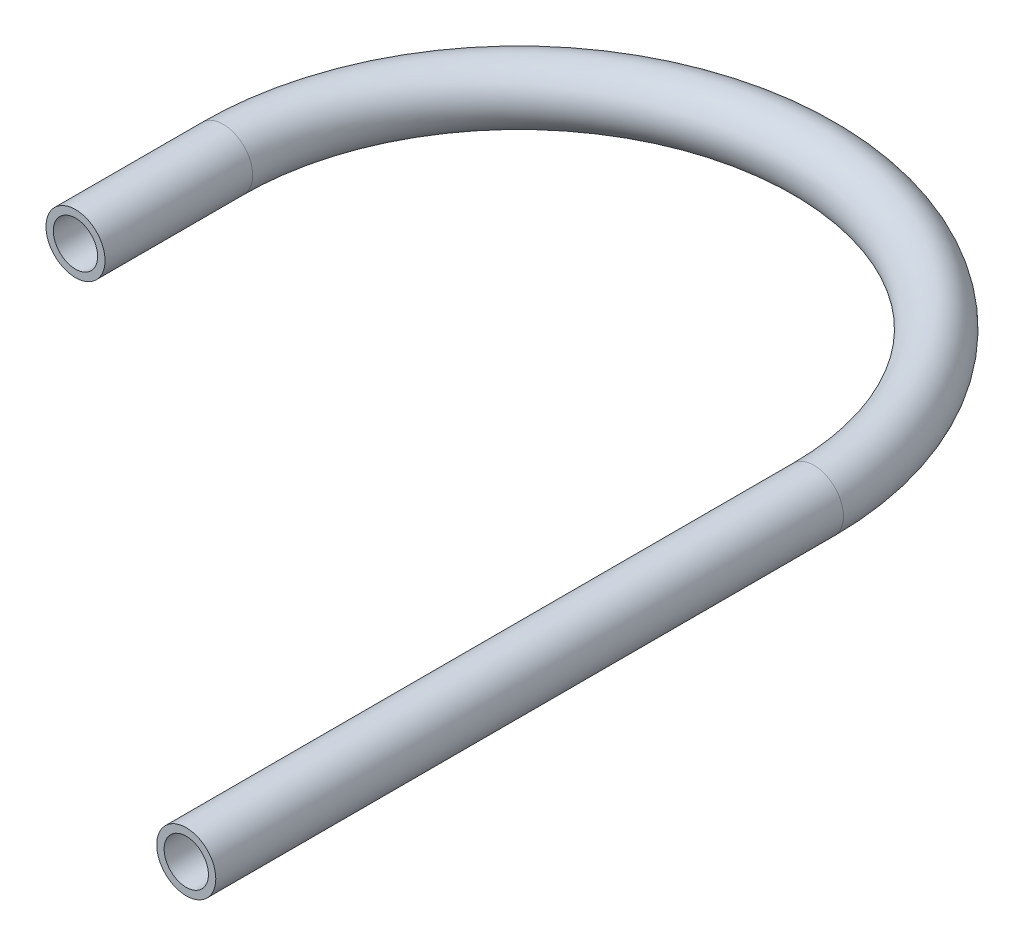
ISO-10303-21;
HEADER;
FILE_DESCRIPTION(('STEP AP214'),'2;1');
FILE_NAME('part.step','',(''),(''),'','','');
FILE_SCHEMA(('AUTOMOTIVE_DESIGN { 1 0 10303 214 1 1 1 1 }'));
ENDSEC;
DATA;
#1=APPLICATION_CONTEXT('core data for automotive mechanical design processes');
#2=APPLICATION_PROTOCOL_DEFINITION('international standard','automotive_design',2000,#1);
#3=PRODUCT_CONTEXT('',#1,'mechanical');
#4=PRODUCT('Part','Part','',(#3));
#5=PRODUCT_RELATED_PRODUCT_CATEGORY('part','',(#4));
#6=PRODUCT_DEFINITION_FORMATION('','',#4);
#7=PRODUCT_DEFINITION_CONTEXT('part definition',#1,'design');
#8=PRODUCT_DEFINITION('design','',#6,#7);
#9=PRODUCT_DEFINITION_SHAPE('','',#8);
#10=(LENGTH_UNIT() NAMED_UNIT(*) SI_UNIT(.MILLI.,.METRE.));
#11=(NAMED_UNIT(*) PLANE_ANGLE_UNIT() SI_UNIT($,.RADIAN.));
#12=(NAMED_UNIT(*) SI_UNIT($,.STERADIAN.) SOLID_ANGLE_UNIT());
#13=UNCERTAINTY_MEASURE_WITH_UNIT(LENGTH_MEASURE(1.E-05),#10,'distance_accuracy_value','');
#14=(GEOMETRIC_REPRESENTATION_CONTEXT(3) GLOBAL_UNCERTAINTY_ASSIGNED_CONTEXT((#13)) GLOBAL_UNIT_ASSIGNED_CONTEXT((#10,
#11,#12)) REPRESENTATION_CONTEXT('',''));
#15=CARTESIAN_POINT('',(0.,0.,0.));
#16=DIRECTION('',(0.,0.,1.));
#17=DIRECTION('',(1.,0.,0.));
#18=AXIS2_PLACEMENT_3D('',#15,#16,#17);
#19=CARTESIAN_POINT('',(0.,0.,0.));
#20=DIRECTION('',(0.,1.,0.));
#21=DIRECTION('',(-1.,0.,0.));
#22=AXIS2_PLACEMENT_3D('',#19,#20,#21);
#23=TOROIDAL_SURFACE('',#22,80.,6.);
#24=CARTESIAN_POINT('',(80.,0.,0.));
#25=DIRECTION('',(0.,0.,1.));
#26=DIRECTION('',(1.,0.,0.));
#27=AXIS2_PLACEMENT_3D('',#24,#25,#26);
#28=CIRCLE('',#27,6.);
#29=CARTESIAN_POINT('',(86.,0.,0.));
#30=VERTEX_POINT('',#29);
#31=EDGE_CURVE('E36',#30,#30,#28,.T.);
#32=ORIENTED_EDGE('',*,*,#31,.T.);
#33=EDGE_LOOP('',(#32));
#34=FACE_BOUND('',#33,.T.);
#35=CARTESIAN_POINT('',(-80.,0.,0.));
#36=DIRECTION('',(0.,0.,1.));
#37=DIRECTION('',(1.,0.,0.));
#38=AXIS2_PLACEMENT_3D('',#35,#36,#37);
#39=CIRCLE('',#38,6.);
#40=CARTESIAN_POINT('',(-74.,0.,0.));
#41=VERTEX_POINT('',#40);
#42=EDGE_CURVE('E34',#41,#41,#39,.T.);
#43=ORIENTED_EDGE('',*,*,#42,.T.);
#44=EDGE_LOOP('',(#43));
#45=FACE_BOUND('',#44,.T.);
#46=ADVANCED_FACE('F14',(#34,#45),#23,.F.);
#47=CARTESIAN_POINT('',(80.,0.,0.));
#48=DIRECTION('',(0.,0.,1.));
#49=DIRECTION('',(1.,0.,0.));
#50=AXIS2_PLACEMENT_3D('',#47,#48,#49);
#51=CYLINDRICAL_SURFACE('',#50,6.);
#52=CARTESIAN_POINT('',(80.,0.,170.));
#53=DIRECTION('',(0.,0.,1.));
#54=DIRECTION('',(1.,0.,0.));
#55=AXIS2_PLACEMENT_3D('',#52,#53,#54);
#56=CIRCLE('',#55,6.);
#57=CARTESIAN_POINT('',(86.,0.,170.));
#58=VERTEX_POINT('',#57);
#59=EDGE_CURVE('E18',#58,#58,#56,.F.);
#60=ORIENTED_EDGE('',*,*,#59,.F.);
#61=EDGE_LOOP('',(#60));
#62=FACE_BOUND('',#61,.T.);
#63=ORIENTED_EDGE('',*,*,#31,.F.);
#64=EDGE_LOOP('',(#63));
#65=FACE_BOUND('',#64,.T.);
#66=ADVANCED_FACE('F55',(#62,#65),#51,.F.);
#67=CARTESIAN_POINT('',(-80.,0.,0.));
#68=DIRECTION('',(0.,0.,1.));
#69=DIRECTION('',(1.,0.,0.));
#70=AXIS2_PLACEMENT_3D('',#67,#68,#69);
#71=CYLINDRICAL_SURFACE('',#70,6.);
#72=CARTESIAN_POINT('',(-80.,0.,40.));
#73=DIRECTION('',(0.,0.,1.));
#74=DIRECTION('',(1.,0.,0.));
#75=AXIS2_PLACEMENT_3D('',#72,#73,#74);
#76=CIRCLE('',#75,6.);
#77=CARTESIAN_POINT('',(-74.,0.,40.));
#78=VERTEX_POINT('',#77);
#79=EDGE_CURVE('E45',#78,#78,#76,.F.);
#80=ORIENTED_EDGE('',*,*,#79,.F.);
#81=EDGE_LOOP('',(#80));
#82=FACE_BOUND('',#81,.T.);
#83=ORIENTED_EDGE('',*,*,#42,.F.);
#84=EDGE_LOOP('',(#83));
#85=FACE_BOUND('',#84,.T.);
#86=ADVANCED_FACE('F58',(#82,#85),#71,.F.);
#87=CARTESIAN_POINT('',(0.,0.,170.));
#88=DIRECTION('',(0.,0.,1.));
#89=DIRECTION('',(1.,0.,0.));
#90=AXIS2_PLACEMENT_3D('',#87,#88,#89);
#91=PLANE('',#90);
#92=ORIENTED_EDGE('',*,*,#59,.T.);
#93=EDGE_LOOP('',(#92));
#94=FACE_BOUND('',#93,.T.);
#95=CARTESIAN_POINT('',(80.,0.,170.));
#96=DIRECTION('',(0.,0.,1.));
#97=DIRECTION('',(1.,0.,0.));
#98=AXIS2_PLACEMENT_3D('',#95,#96,#97);
#99=CIRCLE('',#98,8.);
#100=CARTESIAN_POINT('',(88.,0.,170.));
#101=VERTEX_POINT('',#100);
#102=EDGE_CURVE('E43',#101,#101,#99,.F.);
#103=ORIENTED_EDGE('',*,*,#102,.F.);
#104=EDGE_LOOP('',(#103));
#105=FACE_BOUND('',#104,.T.);
#106=ADVANCED_FACE('F52',(#94,#105),#91,.T.);
#107=CARTESIAN_POINT('',(0.,0.,40.));
#108=DIRECTION('',(0.,0.,1.));
#109=DIRECTION('',(1.,0.,0.));
#110=AXIS2_PLACEMENT_3D('',#107,#108,#109);
#111=PLANE('',#110);
#112=ORIENTED_EDGE('',*,*,#79,.T.);
#113=EDGE_LOOP('',(#112));
#114=FACE_BOUND('',#113,.T.);
#115=CARTESIAN_POINT('',(-80.,0.,40.));
#116=DIRECTION('',(0.,0.,1.));
#117=DIRECTION('',(1.,0.,0.));
#118=AXIS2_PLACEMENT_3D('',#115,#116,#117);
#119=CIRCLE('',#118,8.);
#120=CARTESIAN_POINT('',(-72.,0.,40.));
#121=VERTEX_POINT('',#120);
#122=EDGE_CURVE('E27',#121,#121,#119,.F.);
#123=ORIENTED_EDGE('',*,*,#122,.F.);
#124=EDGE_LOOP('',(#123));
#125=FACE_BOUND('',#124,.T.);
#126=ADVANCED_FACE('F73',(#114,#125),#111,.T.);
#127=CARTESIAN_POINT('',(80.,0.,0.));
#128=DIRECTION('',(0.,0.,1.));
#129=DIRECTION('',(1.,0.,0.));
#130=AXIS2_PLACEMENT_3D('',#127,#128,#129);
#131=CYLINDRICAL_SURFACE('',#130,8.);
#132=ORIENTED_EDGE('',*,*,#102,.T.);
#133=EDGE_LOOP('',(#132));
#134=FACE_BOUND('',#133,.T.);
#135=CARTESIAN_POINT('',(80.,0.,0.));
#136=DIRECTION('',(0.,0.,-1.));
#137=DIRECTION('',(1.,0.,0.));
#138=AXIS2_PLACEMENT_3D('',#135,#136,#137);
#139=CIRCLE('',#138,8.);
#140=CARTESIAN_POINT('',(88.,0.,0.));
#141=VERTEX_POINT('',#140);
#142=EDGE_CURVE('E22',#141,#141,#139,.T.);
#143=ORIENTED_EDGE('',*,*,#142,.F.);
#144=EDGE_LOOP('',(#143));
#145=FACE_BOUND('',#144,.T.);
#146=ADVANCED_FACE('F84',(#134,#145),#131,.T.);
#147=CARTESIAN_POINT('',(-80.,0.,0.));
#148=DIRECTION('',(0.,0.,1.));
#149=DIRECTION('',(1.,0.,0.));
#150=AXIS2_PLACEMENT_3D('',#147,#148,#149);
#151=CYLINDRICAL_SURFACE('',#150,8.);
#152=ORIENTED_EDGE('',*,*,#122,.T.);
#153=EDGE_LOOP('',(#152));
#154=FACE_BOUND('',#153,.T.);
#155=CARTESIAN_POINT('',(-80.,0.,0.));
#156=DIRECTION('',(0.,0.,1.));
#157=DIRECTION('',(-1.,0.,0.));
#158=AXIS2_PLACEMENT_3D('',#155,#156,#157);
#159=CIRCLE('',#158,8.);
#160=CARTESIAN_POINT('',(-88.,0.,0.));
#161=VERTEX_POINT('',#160);
#162=EDGE_CURVE('E10',#161,#161,#159,.F.);
#163=ORIENTED_EDGE('',*,*,#162,.F.);
#164=EDGE_LOOP('',(#163));
#165=FACE_BOUND('',#164,.T.);
#166=ADVANCED_FACE('F77',(#154,#165),#151,.T.);
#167=CARTESIAN_POINT('',(0.,0.,0.));
#168=DIRECTION('',(0.,1.,0.));
#169=DIRECTION('',(-1.,0.,0.));
#170=AXIS2_PLACEMENT_3D('',#167,#168,#169);
#171=TOROIDAL_SURFACE('',#170,80.,8.);
#172=ORIENTED_EDGE('',*,*,#142,.T.);
#173=EDGE_LOOP('',(#172));
#174=FACE_BOUND('',#173,.T.);
#175=ORIENTED_EDGE('',*,*,#162,.T.);
#176=EDGE_LOOP('',(#175));
#177=FACE_BOUND('',#176,.T.);
#178=ADVANCED_FACE('F75',(#174,#177),#171,.T.);
#179=CLOSED_SHELL('',(#46,#66,#86,#106,#126,#146,#166,#178));
#180=MANIFOLD_SOLID_BREP('B1',#179);
#181=ADVANCED_BREP_SHAPE_REPRESENTATION('',(#18,#180),#14);
#182=SHAPE_DEFINITION_REPRESENTATION(#9,#181);
ENDSEC;
END-ISO-10303-21;
